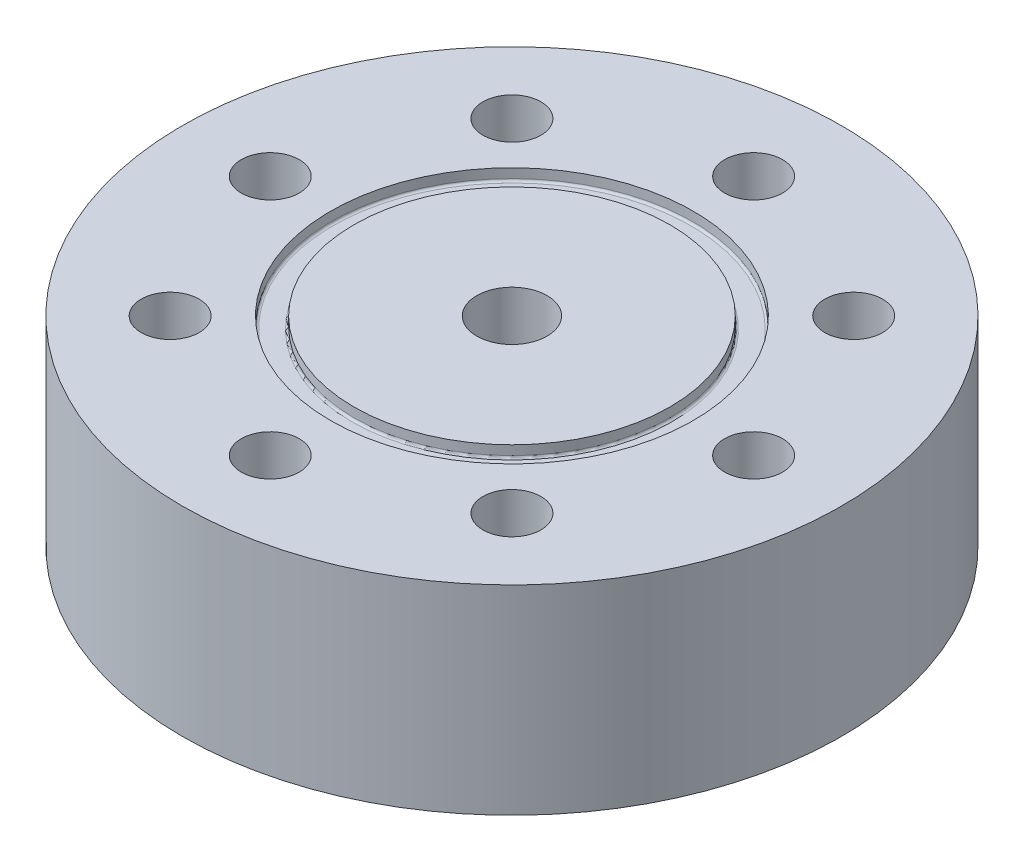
from build123d import *

# Parameters (mm, degrees)
SKETCH2_R                 = 37.5
OUTER_CYLINDER_DEPTH      = 22.7
SKETCH3_R                 = 8.93
NPT_HOLE_DEPTH            = 12.7
SKETCH4_R                 = 3.3
BOLT_HOLES_DEPTH          = 58.687000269
SKETCH5_R                 = 20.6375
SKETCH5_R_2               = 17.9705
O_RING_GROOVE_DEPTH       = 1.3208
FILLET1_R                 = 0.254
SKETCH6_R                 = 4
INLET_FLOW_DIAMETER_DEPTH = 10


with BuildPart() as part:
    # Sketch2 → Outer Cylinder (new body)
    with BuildSketch(Plane(origin=(0, 0, 0), x_dir=(1, 0, 0), z_dir=(0, 1, 0))):
        with Locations(Location((0, 0, 0), (0, 0, 270))):
            Circle(SKETCH2_R)
    extrude(amount=OUTER_CYLINDER_DEPTH)

    # Sketch3 → NPT Hole (cut)
    with BuildSketch(Plane.XZ):
        with Locations(Location((0, 0, 0), (0, 0, 270))):
            Circle(SKETCH3_R)
    extrude(amount=-NPT_HOLE_DEPTH, mode=Mode.SUBTRACT)

    # Sketch4 → Bolt Holes (cut, through all)
    with BuildSketch(Plane.XZ):
        with Locations(Location((-27.5, 0, 0), (0, 0, 270))):
            Circle(SKETCH4_R)
        with Locations(Location((-19.445436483, 19.445436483, 0), (0, 0, 270))):
            Circle(SKETCH4_R)
        with Locations(Location((0, 27.5, 0), (0, 0, 270))):
            Circle(SKETCH4_R)
        with Locations(Location((19.445436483, 19.445436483, 0), (0, 0, 270))):
            Circle(SKETCH4_R)
        with Locations(Location((27.5, 0, 0), (0, 0, 270))):
            Circle(SKETCH4_R)
        with Locations(Location((19.445436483, -19.445436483, 0), (0, 0, 270))):
            Circle(SKETCH4_R)
        with Locations(Location((0, -27.5, 0), (0, 0, 270))):
            Circle(SKETCH4_R)
        with Locations(Location((-19.445436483, -19.445436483, 0), (0, 0, 270))):
            Circle(SKETCH4_R)
    extrude(amount=-BOLT_HOLES_DEPTH, mode=Mode.SUBTRACT)

    # Sketch5 → O-Ring Groove (cut)
    with BuildSketch(Plane(origin=(0, 22.7, 0), x_dir=(1, 0, 0), z_dir=(0, 1, 0))):
        with Locations(Location((0, 0, 0), (0, 0, 270))):
            Circle(SKETCH5_R)
        with Locations(Location((0, 0, 0), (0, 0, 270))):
            Circle(SKETCH5_R_2, mode=Mode.SUBTRACT)
    extrude(amount=-O_RING_GROOVE_DEPTH, mode=Mode.SUBTRACT)

    # Fillet1
    fillet1_edges = [part.edges().sort_by_distance(p)[0] for p in [
        (0, 21.3792, -20.6375),
        (0, 21.3792, -17.9705),
    ]]
    fillet(fillet1_edges, radius=FILLET1_R)

    # Sketch6 → Inlet Flow Diameter (cut)
    with BuildSketch(Plane(origin=(0, 22.7, 0), x_dir=(1, 0, 0), z_dir=(0, 1, 0))):
        with Locations(Location((0, 0, 0), (0, 0, 270))):
            Circle(SKETCH6_R)
    extrude(amount=-INLET_FLOW_DIAMETER_DEPTH, mode=Mode.SUBTRACT)


solid = part.part
